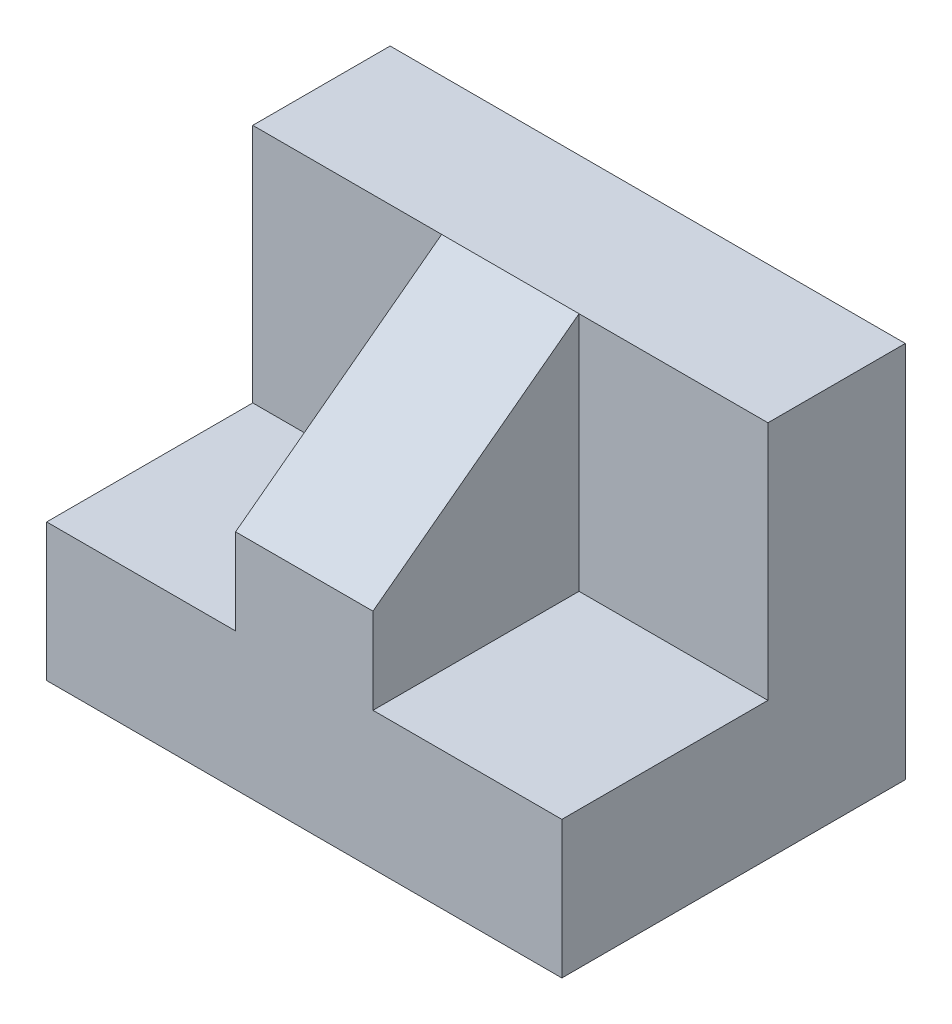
from build123d import *

# Parameters (mm, degrees)
SKETCH_1_W      = 30
SKETCH_1_H      = 20
EXTRUDE_1_DEPTH = 8
SKETCH_2_W      = 30
SKETCH_2_H      = 8
EXTRUDE_2_DEPTH = 14
EXTRUDE_3_DEPTH = 8


with BuildPart() as part:
    # Sketch 1 → Extrude 1 (new body)
    with BuildSketch(Plane(origin=(0, 0, 0), x_dir=(1, 0, 0), z_dir=(0, 1, 0))):
        with Locations((15, 10)):
            Rectangle(SKETCH_1_W, SKETCH_1_H)
    extrude(amount=EXTRUDE_1_DEPTH)

    # Sketch 2 → Extrude 2 (add)
    with BuildSketch(Plane(origin=(0, 8, 0), x_dir=(1, 0, 0), z_dir=(0, 1, 0))):
        with Locations((15, 16)):
            Rectangle(SKETCH_2_W, SKETCH_2_H)
    extrude(amount=EXTRUDE_2_DEPTH)

    # Sketch 3 → Extrude 3 (add)
    with BuildSketch(Plane(origin=(11, 0, 0), x_dir=(0, 0, -1), z_dir=(1, 0, 0))):
        Polygon((12, 22), (0, 13), (0, 8), (12, 8), align=None)
    extrude(amount=EXTRUDE_3_DEPTH)


solid = part.part
